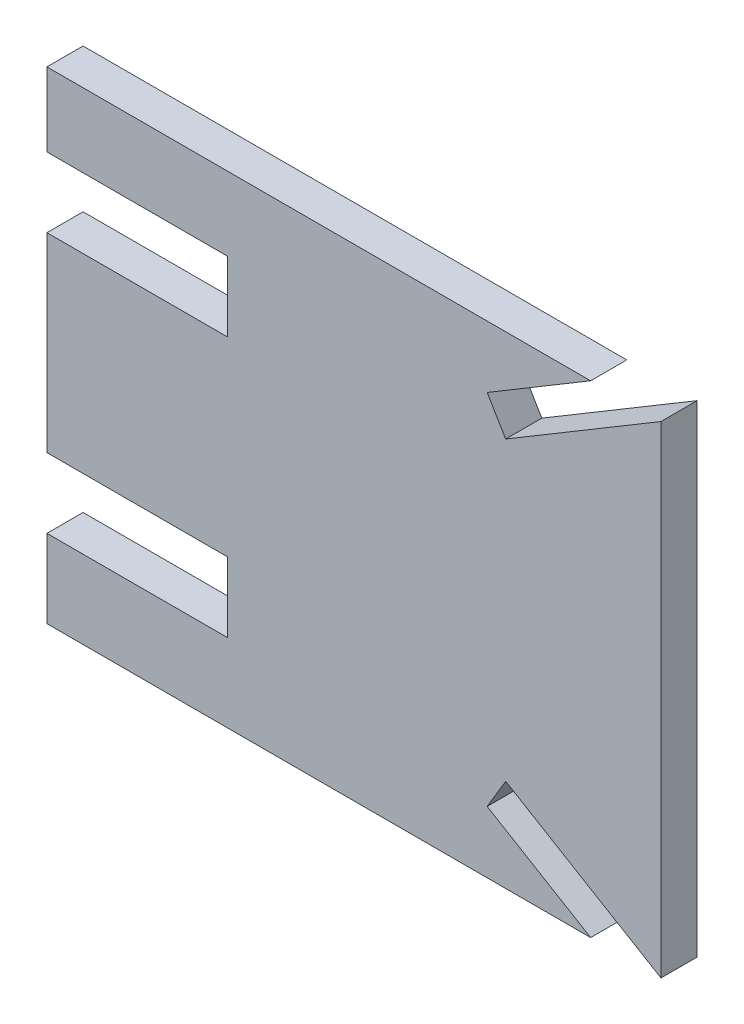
ISO-10303-21;
HEADER;
FILE_DESCRIPTION(('STEP AP214'),'2;1');
FILE_NAME('part.step','',(''),(''),'','','');
FILE_SCHEMA(('AUTOMOTIVE_DESIGN { 1 0 10303 214 1 1 1 1 }'));
ENDSEC;
DATA;
#1=APPLICATION_CONTEXT('core data for automotive mechanical design processes');
#2=APPLICATION_PROTOCOL_DEFINITION('international standard','automotive_design',2000,#1);
#3=PRODUCT_CONTEXT('',#1,'mechanical');
#4=PRODUCT('Part','Part','',(#3));
#5=PRODUCT_RELATED_PRODUCT_CATEGORY('part','',(#4));
#6=PRODUCT_DEFINITION_FORMATION('','',#4);
#7=PRODUCT_DEFINITION_CONTEXT('part definition',#1,'design');
#8=PRODUCT_DEFINITION('design','',#6,#7);
#9=PRODUCT_DEFINITION_SHAPE('','',#8);
#10=(LENGTH_UNIT() NAMED_UNIT(*) SI_UNIT(.MILLI.,.METRE.));
#11=(NAMED_UNIT(*) PLANE_ANGLE_UNIT() SI_UNIT($,.RADIAN.));
#12=(NAMED_UNIT(*) SI_UNIT($,.STERADIAN.) SOLID_ANGLE_UNIT());
#13=UNCERTAINTY_MEASURE_WITH_UNIT(LENGTH_MEASURE(1.E-05),#10,'distance_accuracy_value','');
#14=(GEOMETRIC_REPRESENTATION_CONTEXT(3) GLOBAL_UNCERTAINTY_ASSIGNED_CONTEXT((#13)) GLOBAL_UNIT_ASSIGNED_CONTEXT((#10,
#11,#12)) REPRESENTATION_CONTEXT('',''));
#15=CARTESIAN_POINT('',(0.,0.,0.));
#16=DIRECTION('',(0.,0.,1.));
#17=DIRECTION('',(1.,0.,0.));
#18=AXIS2_PLACEMENT_3D('',#15,#16,#17);
#19=CARTESIAN_POINT('',(-22.5526883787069,13.7,3.));
#20=DIRECTION('',(1.,0.,0.));
#21=DIRECTION('',(0.,0.,-1.));
#22=AXIS2_PLACEMENT_3D('',#19,#20,#21);
#23=PLANE('',#22);
#24=DIRECTION('',(0.,-1.,0.));
#25=VECTOR('',#24,1.);
#26=CARTESIAN_POINT('',(-22.5526883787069,13.7,0.));
#27=LINE('',#26,#25);
#28=CARTESIAN_POINT('',(-22.5526883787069,19.8115386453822,0.));
#29=VERTEX_POINT('',#28);
#30=CARTESIAN_POINT('',(-22.5526883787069,13.7,0.));
#31=VERTEX_POINT('',#30);
#32=EDGE_CURVE('E194',#29,#31,#27,.T.);
#33=ORIENTED_EDGE('',*,*,#32,.T.);
#34=DIRECTION('',(0.,0.,-1.));
#35=VECTOR('',#34,1.);
#36=CARTESIAN_POINT('',(-22.5526883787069,13.7,3.));
#37=LINE('',#36,#35);
#38=CARTESIAN_POINT('',(-22.5526883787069,13.7,3.));
#39=VERTEX_POINT('',#38);
#40=EDGE_CURVE('E11',#39,#31,#37,.T.);
#41=ORIENTED_EDGE('',*,*,#40,.F.);
#42=DIRECTION('',(0.,-1.,0.));
#43=VECTOR('',#42,1.);
#44=CARTESIAN_POINT('',(-22.5526883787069,13.7,3.));
#45=LINE('',#44,#43);
#46=CARTESIAN_POINT('',(-22.5526883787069,19.8115386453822,3.));
#47=VERTEX_POINT('',#46);
#48=EDGE_CURVE('E226',#47,#39,#45,.T.);
#49=ORIENTED_EDGE('',*,*,#48,.F.);
#50=DIRECTION('',(0.,0.,-1.));
#51=VECTOR('',#50,1.);
#52=CARTESIAN_POINT('',(-22.5526883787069,19.8115386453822,3.));
#53=LINE('',#52,#51);
#54=EDGE_CURVE('E191',#47,#29,#53,.T.);
#55=ORIENTED_EDGE('',*,*,#54,.T.);
#56=EDGE_LOOP('',(#33,#41,#49,#55));
#57=FACE_BOUND('',#56,.T.);
#58=ADVANCED_FACE('F39',(#57),#23,.F.);
#59=CARTESIAN_POINT('',(-22.5526883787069,13.7,3.));
#60=DIRECTION('',(0.,1.,0.));
#61=DIRECTION('',(0.,0.,1.));
#62=AXIS2_PLACEMENT_3D('',#59,#60,#61);
#63=PLANE('',#62);
#64=DIRECTION('',(1.,0.,0.));
#65=VECTOR('',#64,1.);
#66=CARTESIAN_POINT('',(-22.5526883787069,13.7,0.));
#67=LINE('',#66,#65);
#68=CARTESIAN_POINT('',(-7.55268837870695,13.7,0.));
#69=VERTEX_POINT('',#68);
#70=EDGE_CURVE('E196',#31,#69,#67,.T.);
#71=ORIENTED_EDGE('',*,*,#70,.T.);
#72=DIRECTION('',(0.,0.,-1.));
#73=VECTOR('',#72,1.);
#74=CARTESIAN_POINT('',(-7.55268837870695,13.7,3.));
#75=LINE('',#74,#73);
#76=CARTESIAN_POINT('',(-7.55268837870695,13.7,3.));
#77=VERTEX_POINT('',#76);
#78=EDGE_CURVE('E50',#77,#69,#75,.T.);
#79=ORIENTED_EDGE('',*,*,#78,.F.);
#80=DIRECTION('',(1.,0.,0.));
#81=VECTOR('',#80,1.);
#82=CARTESIAN_POINT('',(-22.5526883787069,13.7,3.));
#83=LINE('',#82,#81);
#84=EDGE_CURVE('E126',#39,#77,#83,.T.);
#85=ORIENTED_EDGE('',*,*,#84,.F.);
#86=ORIENTED_EDGE('',*,*,#40,.T.);
#87=EDGE_LOOP('',(#71,#79,#85,#86));
#88=FACE_BOUND('',#87,.T.);
#89=ADVANCED_FACE('F340',(#88),#63,.F.);
#90=CARTESIAN_POINT('',(-7.55268837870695,13.7,3.));
#91=DIRECTION('',(1.,0.,0.));
#92=DIRECTION('',(0.,1.,0.));
#93=AXIS2_PLACEMENT_3D('',#90,#91,#92);
#94=PLANE('',#93);
#95=DIRECTION('',(0.,-1.,0.));
#96=VECTOR('',#95,1.);
#97=CARTESIAN_POINT('',(-7.55268837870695,13.7,0.));
#98=LINE('',#97,#96);
#99=CARTESIAN_POINT('',(-7.55268837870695,7.9,0.));
#100=VERTEX_POINT('',#99);
#101=EDGE_CURVE('E199',#69,#100,#98,.T.);
#102=ORIENTED_EDGE('',*,*,#101,.T.);
#103=DIRECTION('',(0.,0.,-1.));
#104=VECTOR('',#103,1.);
#105=CARTESIAN_POINT('',(-7.55268837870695,7.9,3.));
#106=LINE('',#105,#104);
#107=CARTESIAN_POINT('',(-7.55268837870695,7.9,3.));
#108=VERTEX_POINT('',#107);
#109=EDGE_CURVE('E266',#108,#100,#106,.T.);
#110=ORIENTED_EDGE('',*,*,#109,.F.);
#111=DIRECTION('',(0.,-1.,0.));
#112=VECTOR('',#111,1.);
#113=CARTESIAN_POINT('',(-7.55268837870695,13.7,3.));
#114=LINE('',#113,#112);
#115=EDGE_CURVE('E273',#77,#108,#114,.T.);
#116=ORIENTED_EDGE('',*,*,#115,.F.);
#117=ORIENTED_EDGE('',*,*,#78,.T.);
#118=EDGE_LOOP('',(#102,#110,#116,#117));
#119=FACE_BOUND('',#118,.T.);
#120=ADVANCED_FACE('F275',(#119),#94,.F.);
#121=CARTESIAN_POINT('',(-7.55268837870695,7.9,3.));
#122=DIRECTION('',(0.,-1.,0.));
#123=DIRECTION('',(0.,0.,-1.));
#124=AXIS2_PLACEMENT_3D('',#121,#122,#123);
#125=PLANE('',#124);
#126=DIRECTION('',(-1.,0.,0.));
#127=VECTOR('',#126,1.);
#128=CARTESIAN_POINT('',(-7.55268837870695,7.9,0.));
#129=LINE('',#128,#127);
#130=CARTESIAN_POINT('',(-22.5526883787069,7.9,0.));
#131=VERTEX_POINT('',#130);
#132=EDGE_CURVE('E205',#100,#131,#129,.T.);
#133=ORIENTED_EDGE('',*,*,#132,.T.);
#134=DIRECTION('',(0.,0.,-1.));
#135=VECTOR('',#134,1.);
#136=CARTESIAN_POINT('',(-22.5526883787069,7.9,3.));
#137=LINE('',#136,#135);
#138=CARTESIAN_POINT('',(-22.5526883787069,7.9,3.));
#139=VERTEX_POINT('',#138);
#140=EDGE_CURVE('E263',#139,#131,#137,.T.);
#141=ORIENTED_EDGE('',*,*,#140,.F.);
#142=DIRECTION('',(-1.,0.,0.));
#143=VECTOR('',#142,1.);
#144=CARTESIAN_POINT('',(-7.55268837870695,7.9,3.));
#145=LINE('',#144,#143);
#146=EDGE_CURVE('E295',#108,#139,#145,.T.);
#147=ORIENTED_EDGE('',*,*,#146,.F.);
#148=ORIENTED_EDGE('',*,*,#109,.T.);
#149=EDGE_LOOP('',(#133,#141,#147,#148));
#150=FACE_BOUND('',#149,.T.);
#151=ADVANCED_FACE('F284',(#150),#125,.F.);
#152=CARTESIAN_POINT('',(-22.5526883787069,-7.9,3.));
#153=DIRECTION('',(1.,0.,0.));
#154=DIRECTION('',(0.,0.,-1.));
#155=AXIS2_PLACEMENT_3D('',#152,#153,#154);
#156=PLANE('',#155);
#157=DIRECTION('',(0.,-1.,0.));
#158=VECTOR('',#157,1.);
#159=CARTESIAN_POINT('',(-22.5526883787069,-7.9,0.));
#160=LINE('',#159,#158);
#161=CARTESIAN_POINT('',(-22.5526883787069,-7.9,0.));
#162=VERTEX_POINT('',#161);
#163=EDGE_CURVE('E204',#131,#162,#160,.T.);
#164=ORIENTED_EDGE('',*,*,#163,.T.);
#165=DIRECTION('',(0.,0.,-1.));
#166=VECTOR('',#165,1.);
#167=CARTESIAN_POINT('',(-22.5526883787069,-7.9,3.));
#168=LINE('',#167,#166);
#169=CARTESIAN_POINT('',(-22.5526883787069,-7.9,3.));
#170=VERTEX_POINT('',#169);
#171=EDGE_CURVE('E257',#170,#162,#168,.T.);
#172=ORIENTED_EDGE('',*,*,#171,.F.);
#173=DIRECTION('',(0.,-1.,0.));
#174=VECTOR('',#173,1.);
#175=CARTESIAN_POINT('',(-22.5526883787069,-7.9,3.));
#176=LINE('',#175,#174);
#177=EDGE_CURVE('E287',#139,#170,#176,.T.);
#178=ORIENTED_EDGE('',*,*,#177,.F.);
#179=ORIENTED_EDGE('',*,*,#140,.T.);
#180=EDGE_LOOP('',(#164,#172,#178,#179));
#181=FACE_BOUND('',#180,.T.);
#182=ADVANCED_FACE('F290',(#181),#156,.F.);
#183=CARTESIAN_POINT('',(-22.5526883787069,-7.9,3.));
#184=DIRECTION('',(0.,1.,0.));
#185=DIRECTION('',(-1.,0.,0.));
#186=AXIS2_PLACEMENT_3D('',#183,#184,#185);
#187=PLANE('',#186);
#188=DIRECTION('',(1.,0.,0.));
#189=VECTOR('',#188,1.);
#190=CARTESIAN_POINT('',(-22.5526883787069,-7.9,0.));
#191=LINE('',#190,#189);
#192=CARTESIAN_POINT('',(-7.55268837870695,-7.9,0.));
#193=VERTEX_POINT('',#192);
#194=EDGE_CURVE('E206',#162,#193,#191,.T.);
#195=ORIENTED_EDGE('',*,*,#194,.T.);
#196=DIRECTION('',(0.,0.,-1.));
#197=VECTOR('',#196,1.);
#198=CARTESIAN_POINT('',(-7.55268837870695,-7.9,3.));
#199=LINE('',#198,#197);
#200=CARTESIAN_POINT('',(-7.55268837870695,-7.9,3.));
#201=VERTEX_POINT('',#200);
#202=EDGE_CURVE('E260',#201,#193,#199,.T.);
#203=ORIENTED_EDGE('',*,*,#202,.F.);
#204=DIRECTION('',(1.,0.,0.));
#205=VECTOR('',#204,1.);
#206=CARTESIAN_POINT('',(-22.5526883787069,-7.9,3.));
#207=LINE('',#206,#205);
#208=EDGE_CURVE('E292',#170,#201,#207,.T.);
#209=ORIENTED_EDGE('',*,*,#208,.F.);
#210=ORIENTED_EDGE('',*,*,#171,.T.);
#211=EDGE_LOOP('',(#195,#203,#209,#210));
#212=FACE_BOUND('',#211,.T.);
#213=ADVANCED_FACE('F348',(#212),#187,.F.);
#214=CARTESIAN_POINT('',(-7.55268837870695,-7.9,3.));
#215=DIRECTION('',(1.,0.,0.));
#216=DIRECTION('',(0.,1.,0.));
#217=AXIS2_PLACEMENT_3D('',#214,#215,#216);
#218=PLANE('',#217);
#219=DIRECTION('',(0.,-1.,0.));
#220=VECTOR('',#219,1.);
#221=CARTESIAN_POINT('',(-7.55268837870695,-7.9,0.));
#222=LINE('',#221,#220);
#223=CARTESIAN_POINT('',(-7.55268837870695,-13.7,0.));
#224=VERTEX_POINT('',#223);
#225=EDGE_CURVE('E208',#193,#224,#222,.T.);
#226=ORIENTED_EDGE('',*,*,#225,.T.);
#227=DIRECTION('',(0.,0.,-1.));
#228=VECTOR('',#227,1.);
#229=CARTESIAN_POINT('',(-7.55268837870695,-13.7,3.));
#230=LINE('',#229,#228);
#231=CARTESIAN_POINT('',(-7.55268837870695,-13.7,3.));
#232=VERTEX_POINT('',#231);
#233=EDGE_CURVE('E255',#232,#224,#230,.T.);
#234=ORIENTED_EDGE('',*,*,#233,.F.);
#235=DIRECTION('',(0.,-1.,0.));
#236=VECTOR('',#235,1.);
#237=CARTESIAN_POINT('',(-7.55268837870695,-7.9,3.));
#238=LINE('',#237,#236);
#239=EDGE_CURVE('E294',#201,#232,#238,.T.);
#240=ORIENTED_EDGE('',*,*,#239,.F.);
#241=ORIENTED_EDGE('',*,*,#202,.T.);
#242=EDGE_LOOP('',(#226,#234,#240,#241));
#243=FACE_BOUND('',#242,.T.);
#244=ADVANCED_FACE('F354',(#243),#218,.F.);
#245=CARTESIAN_POINT('',(-7.55268837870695,-13.7,3.));
#246=DIRECTION('',(0.,-1.,0.));
#247=DIRECTION('',(1.,0.,0.));
#248=AXIS2_PLACEMENT_3D('',#245,#246,#247);
#249=PLANE('',#248);
#250=DIRECTION('',(-1.,0.,0.));
#251=VECTOR('',#250,1.);
#252=CARTESIAN_POINT('',(-7.55268837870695,-13.7,0.));
#253=LINE('',#252,#251);
#254=CARTESIAN_POINT('',(-22.5526883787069,-13.7,0.));
#255=VERTEX_POINT('',#254);
#256=EDGE_CURVE('E209',#224,#255,#253,.T.);
#257=ORIENTED_EDGE('',*,*,#256,.T.);
#258=DIRECTION('',(0.,0.,-1.));
#259=VECTOR('',#258,1.);
#260=CARTESIAN_POINT('',(-22.5526883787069,-13.7,3.));
#261=LINE('',#260,#259);
#262=CARTESIAN_POINT('',(-22.5526883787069,-13.7,3.));
#263=VERTEX_POINT('',#262);
#264=EDGE_CURVE('E253',#263,#255,#261,.T.);
#265=ORIENTED_EDGE('',*,*,#264,.F.);
#266=DIRECTION('',(-1.,0.,0.));
#267=VECTOR('',#266,1.);
#268=CARTESIAN_POINT('',(-7.55268837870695,-13.7,3.));
#269=LINE('',#268,#267);
#270=EDGE_CURVE('E298',#232,#263,#269,.T.);
#271=ORIENTED_EDGE('',*,*,#270,.F.);
#272=ORIENTED_EDGE('',*,*,#233,.T.);
#273=EDGE_LOOP('',(#257,#265,#271,#272));
#274=FACE_BOUND('',#273,.T.);
#275=ADVANCED_FACE('F360',(#274),#249,.F.);
#276=CARTESIAN_POINT('',(-22.552688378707,-20.1880722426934,3.));
#277=DIRECTION('',(1.,0.,0.));
#278=DIRECTION('',(0.,1.,0.));
#279=AXIS2_PLACEMENT_3D('',#276,#277,#278);
#280=PLANE('',#279);
#281=DIRECTION('',(0.,-1.,0.));
#282=VECTOR('',#281,1.);
#283=CARTESIAN_POINT('',(-22.552688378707,-20.1880722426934,0.));
#284=LINE('',#283,#282);
#285=CARTESIAN_POINT('',(-22.552688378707,-20.1880722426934,0.));
#286=VERTEX_POINT('',#285);
#287=EDGE_CURVE('E215',#255,#286,#284,.T.);
#288=ORIENTED_EDGE('',*,*,#287,.T.);
#289=DIRECTION('',(0.,0.,-1.));
#290=VECTOR('',#289,1.);
#291=CARTESIAN_POINT('',(-22.552688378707,-20.1880722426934,3.));
#292=LINE('',#291,#290);
#293=CARTESIAN_POINT('',(-22.552688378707,-20.1880722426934,3.));
#294=VERTEX_POINT('',#293);
#295=EDGE_CURVE('E248',#294,#286,#292,.T.);
#296=ORIENTED_EDGE('',*,*,#295,.F.);
#297=DIRECTION('',(0.,-1.,0.));
#298=VECTOR('',#297,1.);
#299=CARTESIAN_POINT('',(-22.552688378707,-20.1880722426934,3.));
#300=LINE('',#299,#298);
#301=EDGE_CURVE('E305',#263,#294,#300,.T.);
#302=ORIENTED_EDGE('',*,*,#301,.F.);
#303=ORIENTED_EDGE('',*,*,#264,.T.);
#304=EDGE_LOOP('',(#288,#296,#302,#303));
#305=FACE_BOUND('',#304,.T.);
#306=ADVANCED_FACE('F363',(#305),#280,.F.);
#307=CARTESIAN_POINT('',(22.552688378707,-20.1880722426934,3.));
#308=DIRECTION('',(0.,1.,0.));
#309=DIRECTION('',(0.,0.,1.));
#310=AXIS2_PLACEMENT_3D('',#307,#308,#309);
#311=PLANE('',#310);
#312=DIRECTION('',(1.,0.,0.));
#313=VECTOR('',#312,1.);
#314=CARTESIAN_POINT('',(22.552688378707,-20.1880722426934,0.));
#315=LINE('',#314,#313);
#316=CARTESIAN_POINT('',(22.552688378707,-20.1880722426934,0.));
#317=VERTEX_POINT('',#316);
#318=EDGE_CURVE('E212',#286,#317,#315,.T.);
#319=ORIENTED_EDGE('',*,*,#318,.T.);
#320=DIRECTION('',(0.,0.,-1.));
#321=VECTOR('',#320,1.);
#322=CARTESIAN_POINT('',(22.552688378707,-20.1880722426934,3.));
#323=LINE('',#322,#321);
#324=CARTESIAN_POINT('',(22.552688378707,-20.1880722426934,3.));
#325=VERTEX_POINT('',#324);
#326=EDGE_CURVE('E243',#325,#317,#323,.T.);
#327=ORIENTED_EDGE('',*,*,#326,.F.);
#328=DIRECTION('',(1.,0.,0.));
#329=VECTOR('',#328,1.);
#330=CARTESIAN_POINT('',(22.552688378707,-20.1880722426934,3.));
#331=LINE('',#330,#329);
#332=EDGE_CURVE('E302',#294,#325,#331,.T.);
#333=ORIENTED_EDGE('',*,*,#332,.F.);
#334=ORIENTED_EDGE('',*,*,#295,.T.);
#335=EDGE_LOOP('',(#319,#327,#333,#334));
#336=FACE_BOUND('',#335,.T.);
#337=ADVANCED_FACE('F364',(#336),#311,.F.);
#338=CARTESIAN_POINT('',(22.552688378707,-20.1880722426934,3.));
#339=DIRECTION('',(-0.512911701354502,-0.858441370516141,0.));
#340=DIRECTION('',(0.858441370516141,-0.512911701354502,0.));
#341=AXIS2_PLACEMENT_3D('',#338,#339,#340);
#342=PLANE('',#341);
#343=DIRECTION('',(-0.858441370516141,0.512911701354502,0.));
#344=VECTOR('',#343,1.);
#345=CARTESIAN_POINT('',(22.552688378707,-20.1880722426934,0.));
#346=LINE('',#345,#344);
#347=CARTESIAN_POINT('',(13.9682746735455,-15.0589552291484,0.));
#348=VERTEX_POINT('',#347);
#349=EDGE_CURVE('E216',#317,#348,#346,.T.);
#350=ORIENTED_EDGE('',*,*,#349,.T.);
#351=DIRECTION('',(0.,0.,-1.));
#352=VECTOR('',#351,1.);
#353=CARTESIAN_POINT('',(13.9682746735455,-15.0589552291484,3.));
#354=LINE('',#353,#352);
#355=CARTESIAN_POINT('',(13.9682746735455,-15.0589552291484,3.));
#356=VERTEX_POINT('',#355);
#357=EDGE_CURVE('E245',#356,#348,#354,.T.);
#358=ORIENTED_EDGE('',*,*,#357,.F.);
#359=DIRECTION('',(-0.858441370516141,0.512911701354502,0.));
#360=VECTOR('',#359,1.);
#361=CARTESIAN_POINT('',(22.552688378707,-20.1880722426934,3.));
#362=LINE('',#361,#360);
#363=EDGE_CURVE('E308',#325,#356,#362,.T.);
#364=ORIENTED_EDGE('',*,*,#363,.F.);
#365=ORIENTED_EDGE('',*,*,#326,.T.);
#366=EDGE_LOOP('',(#350,#358,#364,#365));
#367=FACE_BOUND('',#366,.T.);
#368=ADVANCED_FACE('F369',(#367),#342,.F.);
#369=CARTESIAN_POINT('',(13.9682746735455,-15.0589552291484,3.));
#370=DIRECTION('',(-0.858441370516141,0.512911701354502,0.));
#371=DIRECTION('',(-0.512911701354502,-0.858441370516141,0.));
#372=AXIS2_PLACEMENT_3D('',#369,#370,#371);
#373=PLANE('',#372);
#374=DIRECTION('',(0.512911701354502,0.85844137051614,0.));
#375=VECTOR('',#374,1.);
#376=CARTESIAN_POINT('',(13.9682746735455,-15.0589552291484,0.));
#377=LINE('',#376,#375);
#378=CARTESIAN_POINT('',(15.507009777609,-12.4836311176,0.));
#379=VERTEX_POINT('',#378);
#380=EDGE_CURVE('E217',#348,#379,#377,.T.);
#381=ORIENTED_EDGE('',*,*,#380,.T.);
#382=DIRECTION('',(0.,0.,-1.));
#383=VECTOR('',#382,1.);
#384=CARTESIAN_POINT('',(15.507009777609,-12.4836311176,3.));
#385=LINE('',#384,#383);
#386=CARTESIAN_POINT('',(15.507009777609,-12.4836311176,3.));
#387=VERTEX_POINT('',#386);
#388=EDGE_CURVE('E239',#387,#379,#385,.T.);
#389=ORIENTED_EDGE('',*,*,#388,.F.);
#390=DIRECTION('',(0.512911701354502,0.85844137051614,0.));
#391=VECTOR('',#390,1.);
#392=CARTESIAN_POINT('',(13.9682746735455,-15.0589552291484,3.));
#393=LINE('',#392,#391);
#394=EDGE_CURVE('E306',#356,#387,#393,.T.);
#395=ORIENTED_EDGE('',*,*,#394,.F.);
#396=ORIENTED_EDGE('',*,*,#357,.T.);
#397=EDGE_LOOP('',(#381,#389,#395,#396));
#398=FACE_BOUND('',#397,.T.);
#399=ADVANCED_FACE('F373',(#398),#373,.F.);
#400=CARTESIAN_POINT('',(15.507009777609,-12.4836311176,3.));
#401=DIRECTION('',(0.512911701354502,0.858441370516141,0.));
#402=DIRECTION('',(-0.858441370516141,0.512911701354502,0.));
#403=AXIS2_PLACEMENT_3D('',#400,#401,#402);
#404=PLANE('',#403);
#405=DIRECTION('',(0.858441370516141,-0.512911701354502,0.));
#406=VECTOR('',#405,1.);
#407=CARTESIAN_POINT('',(15.507009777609,-12.4836311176,0.));
#408=LINE('',#407,#406);
#409=CARTESIAN_POINT('',(28.3836303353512,-20.1773066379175,0.));
#410=VERTEX_POINT('',#409);
#411=EDGE_CURVE('E219',#379,#410,#408,.T.);
#412=ORIENTED_EDGE('',*,*,#411,.T.);
#413=DIRECTION('',(0.,0.,-1.));
#414=VECTOR('',#413,1.);
#415=CARTESIAN_POINT('',(28.3836303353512,-20.1773066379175,3.));
#416=LINE('',#415,#414);
#417=CARTESIAN_POINT('',(28.3836303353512,-20.1773066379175,3.));
#418=VERTEX_POINT('',#417);
#419=EDGE_CURVE('E237',#418,#410,#416,.T.);
#420=ORIENTED_EDGE('',*,*,#419,.F.);
#421=DIRECTION('',(0.858441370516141,-0.512911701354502,0.));
#422=VECTOR('',#421,1.);
#423=CARTESIAN_POINT('',(15.507009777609,-12.4836311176,3.));
#424=LINE('',#423,#422);
#425=EDGE_CURVE('E309',#387,#418,#424,.T.);
#426=ORIENTED_EDGE('',*,*,#425,.F.);
#427=ORIENTED_EDGE('',*,*,#388,.T.);
#428=EDGE_LOOP('',(#412,#420,#426,#427));
#429=FACE_BOUND('',#428,.T.);
#430=ADVANCED_FACE('F380',(#429),#404,.F.);
#431=CARTESIAN_POINT('',(28.3836303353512,-20.1773066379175,3.));
#432=DIRECTION('',(-1.,0.,0.));
#433=DIRECTION('',(0.,-1.,0.));
#434=AXIS2_PLACEMENT_3D('',#431,#432,#433);
#435=PLANE('',#434);
#436=DIRECTION('',(0.,1.,0.));
#437=VECTOR('',#436,1.);
#438=CARTESIAN_POINT('',(28.3836303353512,-20.1773066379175,0.));
#439=LINE('',#438,#437);
#440=CARTESIAN_POINT('',(28.3836303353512,19.8007730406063,0.));
#441=VERTEX_POINT('',#440);
#442=EDGE_CURVE('E225',#410,#441,#439,.T.);
#443=ORIENTED_EDGE('',*,*,#442,.T.);
#444=DIRECTION('',(0.,0.,-1.));
#445=VECTOR('',#444,1.);
#446=CARTESIAN_POINT('',(28.3836303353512,19.8007730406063,3.));
#447=LINE('',#446,#445);
#448=CARTESIAN_POINT('',(28.3836303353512,19.8007730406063,3.));
#449=VERTEX_POINT('',#448);
#450=EDGE_CURVE('E233',#449,#441,#447,.T.);
#451=ORIENTED_EDGE('',*,*,#450,.F.);
#452=DIRECTION('',(0.,1.,0.));
#453=VECTOR('',#452,1.);
#454=CARTESIAN_POINT('',(28.3836303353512,-20.1773066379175,3.));
#455=LINE('',#454,#453);
#456=EDGE_CURVE('E315',#418,#449,#455,.T.);
#457=ORIENTED_EDGE('',*,*,#456,.F.);
#458=ORIENTED_EDGE('',*,*,#419,.T.);
#459=EDGE_LOOP('',(#443,#451,#457,#458));
#460=FACE_BOUND('',#459,.T.);
#461=ADVANCED_FACE('F318',(#460),#435,.F.);
#462=CARTESIAN_POINT('',(15.507009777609,12.1070975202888,3.));
#463=DIRECTION('',(0.512911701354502,-0.85844137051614,0.));
#464=DIRECTION('',(0.858441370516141,0.512911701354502,0.));
#465=AXIS2_PLACEMENT_3D('',#462,#463,#464);
#466=PLANE('',#465);
#467=DIRECTION('',(-0.858441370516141,-0.512911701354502,0.));
#468=VECTOR('',#467,1.);
#469=CARTESIAN_POINT('',(15.507009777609,12.1070975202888,0.));
#470=LINE('',#469,#468);
#471=CARTESIAN_POINT('',(15.507009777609,12.1070975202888,0.));
#472=VERTEX_POINT('',#471);
#473=EDGE_CURVE('E221',#441,#472,#470,.T.);
#474=ORIENTED_EDGE('',*,*,#473,.T.);
#475=DIRECTION('',(0.,0.,-1.));
#476=VECTOR('',#475,1.);
#477=CARTESIAN_POINT('',(15.507009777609,12.1070975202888,3.));
#478=LINE('',#477,#476);
#479=CARTESIAN_POINT('',(15.507009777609,12.1070975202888,3.));
#480=VERTEX_POINT('',#479);
#481=EDGE_CURVE('E187',#480,#472,#478,.T.);
#482=ORIENTED_EDGE('',*,*,#481,.F.);
#483=DIRECTION('',(-0.858441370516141,-0.512911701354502,0.));
#484=VECTOR('',#483,1.);
#485=CARTESIAN_POINT('',(15.507009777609,12.1070975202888,3.));
#486=LINE('',#485,#484);
#487=EDGE_CURVE('E180',#449,#480,#486,.T.);
#488=ORIENTED_EDGE('',*,*,#487,.F.);
#489=ORIENTED_EDGE('',*,*,#450,.T.);
#490=EDGE_LOOP('',(#474,#482,#488,#489));
#491=FACE_BOUND('',#490,.T.);
#492=ADVANCED_FACE('F325',(#491),#466,.F.);
#493=CARTESIAN_POINT('',(13.9682746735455,14.6824216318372,3.));
#494=DIRECTION('',(-0.858441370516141,-0.512911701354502,0.));
#495=DIRECTION('',(0.512911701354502,-0.858441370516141,0.));
#496=AXIS2_PLACEMENT_3D('',#493,#494,#495);
#497=PLANE('',#496);
#498=DIRECTION('',(-0.512911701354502,0.85844137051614,0.));
#499=VECTOR('',#498,1.);
#500=CARTESIAN_POINT('',(13.9682746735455,14.6824216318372,0.));
#501=LINE('',#500,#499);
#502=CARTESIAN_POINT('',(13.9682746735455,14.6824216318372,0.));
#503=VERTEX_POINT('',#502);
#504=EDGE_CURVE('E183',#472,#503,#501,.T.);
#505=ORIENTED_EDGE('',*,*,#504,.T.);
#506=DIRECTION('',(0.,0.,-1.));
#507=VECTOR('',#506,1.);
#508=CARTESIAN_POINT('',(13.9682746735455,14.6824216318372,3.));
#509=LINE('',#508,#507);
#510=CARTESIAN_POINT('',(13.9682746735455,14.6824216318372,3.));
#511=VERTEX_POINT('',#510);
#512=EDGE_CURVE('E185',#511,#503,#509,.T.);
#513=ORIENTED_EDGE('',*,*,#512,.F.);
#514=DIRECTION('',(-0.512911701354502,0.85844137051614,0.));
#515=VECTOR('',#514,1.);
#516=CARTESIAN_POINT('',(13.9682746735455,14.6824216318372,3.));
#517=LINE('',#516,#515);
#518=EDGE_CURVE('E172',#480,#511,#517,.T.);
#519=ORIENTED_EDGE('',*,*,#518,.F.);
#520=ORIENTED_EDGE('',*,*,#481,.T.);
#521=EDGE_LOOP('',(#505,#513,#519,#520));
#522=FACE_BOUND('',#521,.T.);
#523=ADVANCED_FACE('F181',(#522),#497,.F.);
#524=CARTESIAN_POINT('',(22.5526883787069,19.8115386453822,3.));
#525=DIRECTION('',(-0.512911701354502,0.85844137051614,0.));
#526=DIRECTION('',(-0.858441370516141,-0.512911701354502,0.));
#527=AXIS2_PLACEMENT_3D('',#524,#525,#526);
#528=PLANE('',#527);
#529=DIRECTION('',(0.858441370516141,0.512911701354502,0.));
#530=VECTOR('',#529,1.);
#531=CARTESIAN_POINT('',(22.5526883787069,19.8115386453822,0.));
#532=LINE('',#531,#530);
#533=CARTESIAN_POINT('',(22.5526883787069,19.8115386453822,0.));
#534=VERTEX_POINT('',#533);
#535=EDGE_CURVE('E111',#503,#534,#532,.T.);
#536=ORIENTED_EDGE('',*,*,#535,.T.);
#537=DIRECTION('',(0.,0.,-1.));
#538=VECTOR('',#537,1.);
#539=CARTESIAN_POINT('',(22.5526883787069,19.8115386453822,3.));
#540=LINE('',#539,#538);
#541=CARTESIAN_POINT('',(22.5526883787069,19.8115386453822,3.));
#542=VERTEX_POINT('',#541);
#543=EDGE_CURVE('E190',#542,#534,#540,.T.);
#544=ORIENTED_EDGE('',*,*,#543,.F.);
#545=DIRECTION('',(0.858441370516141,0.512911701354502,0.));
#546=VECTOR('',#545,1.);
#547=CARTESIAN_POINT('',(22.5526883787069,19.8115386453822,3.));
#548=LINE('',#547,#546);
#549=EDGE_CURVE('E173',#511,#542,#548,.T.);
#550=ORIENTED_EDGE('',*,*,#549,.F.);
#551=ORIENTED_EDGE('',*,*,#512,.T.);
#552=EDGE_LOOP('',(#536,#544,#550,#551));
#553=FACE_BOUND('',#552,.T.);
#554=ADVANCED_FACE('F186',(#553),#528,.F.);
#555=CARTESIAN_POINT('',(22.5526883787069,19.8115386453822,3.));
#556=DIRECTION('',(0.,-1.,0.));
#557=DIRECTION('',(0.,0.,-1.));
#558=AXIS2_PLACEMENT_3D('',#555,#556,#557);
#559=PLANE('',#558);
#560=DIRECTION('',(-1.,0.,0.));
#561=VECTOR('',#560,1.);
#562=CARTESIAN_POINT('',(22.5526883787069,19.8115386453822,0.));
#563=LINE('',#562,#561);
#564=EDGE_CURVE('E118',#534,#29,#563,.T.);
#565=ORIENTED_EDGE('',*,*,#564,.T.);
#566=ORIENTED_EDGE('',*,*,#54,.F.);
#567=DIRECTION('',(-1.,0.,0.));
#568=VECTOR('',#567,1.);
#569=CARTESIAN_POINT('',(22.5526883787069,19.8115386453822,3.));
#570=LINE('',#569,#568);
#571=EDGE_CURVE('E54',#542,#47,#570,.T.);
#572=ORIENTED_EDGE('',*,*,#571,.F.);
#573=ORIENTED_EDGE('',*,*,#543,.T.);
#574=EDGE_LOOP('',(#565,#566,#572,#573));
#575=FACE_BOUND('',#574,.T.);
#576=ADVANCED_FACE('F326',(#575),#559,.F.);
#577=CARTESIAN_POINT('',(0.,0.,3.));
#578=DIRECTION('',(0.,0.,1.));
#579=DIRECTION('',(1.,0.,0.));
#580=AXIS2_PLACEMENT_3D('',#577,#578,#579);
#581=PLANE('',#580);
#582=ORIENTED_EDGE('',*,*,#48,.T.);
#583=ORIENTED_EDGE('',*,*,#84,.T.);
#584=ORIENTED_EDGE('',*,*,#115,.T.);
#585=ORIENTED_EDGE('',*,*,#146,.T.);
#586=ORIENTED_EDGE('',*,*,#177,.T.);
#587=ORIENTED_EDGE('',*,*,#208,.T.);
#588=ORIENTED_EDGE('',*,*,#239,.T.);
#589=ORIENTED_EDGE('',*,*,#270,.T.);
#590=ORIENTED_EDGE('',*,*,#301,.T.);
#591=ORIENTED_EDGE('',*,*,#332,.T.);
#592=ORIENTED_EDGE('',*,*,#363,.T.);
#593=ORIENTED_EDGE('',*,*,#394,.T.);
#594=ORIENTED_EDGE('',*,*,#425,.T.);
#595=ORIENTED_EDGE('',*,*,#456,.T.);
#596=ORIENTED_EDGE('',*,*,#487,.T.);
#597=ORIENTED_EDGE('',*,*,#518,.T.);
#598=ORIENTED_EDGE('',*,*,#549,.T.);
#599=ORIENTED_EDGE('',*,*,#571,.T.);
#600=EDGE_LOOP('',(#582,#583,#584,#585,#586,#587,#588,#589,#590,#591,#592,#593,#594,#595,#596,
#597,#598,#599));
#601=FACE_BOUND('',#600,.T.);
#602=ADVANCED_FACE('F174',(#601),#581,.T.);
#603=CARTESIAN_POINT('',(0.,0.,0.));
#604=DIRECTION('',(0.,0.,1.));
#605=DIRECTION('',(1.,0.,0.));
#606=AXIS2_PLACEMENT_3D('',#603,#604,#605);
#607=PLANE('',#606);
#608=ORIENTED_EDGE('',*,*,#32,.F.);
#609=ORIENTED_EDGE('',*,*,#564,.F.);
#610=ORIENTED_EDGE('',*,*,#535,.F.);
#611=ORIENTED_EDGE('',*,*,#504,.F.);
#612=ORIENTED_EDGE('',*,*,#473,.F.);
#613=ORIENTED_EDGE('',*,*,#442,.F.);
#614=ORIENTED_EDGE('',*,*,#411,.F.);
#615=ORIENTED_EDGE('',*,*,#380,.F.);
#616=ORIENTED_EDGE('',*,*,#349,.F.);
#617=ORIENTED_EDGE('',*,*,#318,.F.);
#618=ORIENTED_EDGE('',*,*,#287,.F.);
#619=ORIENTED_EDGE('',*,*,#256,.F.);
#620=ORIENTED_EDGE('',*,*,#225,.F.);
#621=ORIENTED_EDGE('',*,*,#194,.F.);
#622=ORIENTED_EDGE('',*,*,#163,.F.);
#623=ORIENTED_EDGE('',*,*,#132,.F.);
#624=ORIENTED_EDGE('',*,*,#101,.F.);
#625=ORIENTED_EDGE('',*,*,#70,.F.);
#626=EDGE_LOOP('',(#608,#609,#610,#611,#612,#613,#614,#615,#616,#617,#618,#619,#620,#621,#622,
#623,#624,#625));
#627=FACE_BOUND('',#626,.T.);
#628=ADVANCED_FACE('F279',(#627),#607,.F.);
#629=CLOSED_SHELL('',(#58,#89,#120,#151,#182,#213,#244,#275,#306,#337,#368,#399,#430,#461,#492,
#523,#554,#576,#602,#628));
#630=MANIFOLD_SOLID_BREP('B2',#629);
#631=ADVANCED_BREP_SHAPE_REPRESENTATION('',(#18,#630),#14);
#632=SHAPE_DEFINITION_REPRESENTATION(#9,#631);
ENDSEC;
END-ISO-10303-21;
